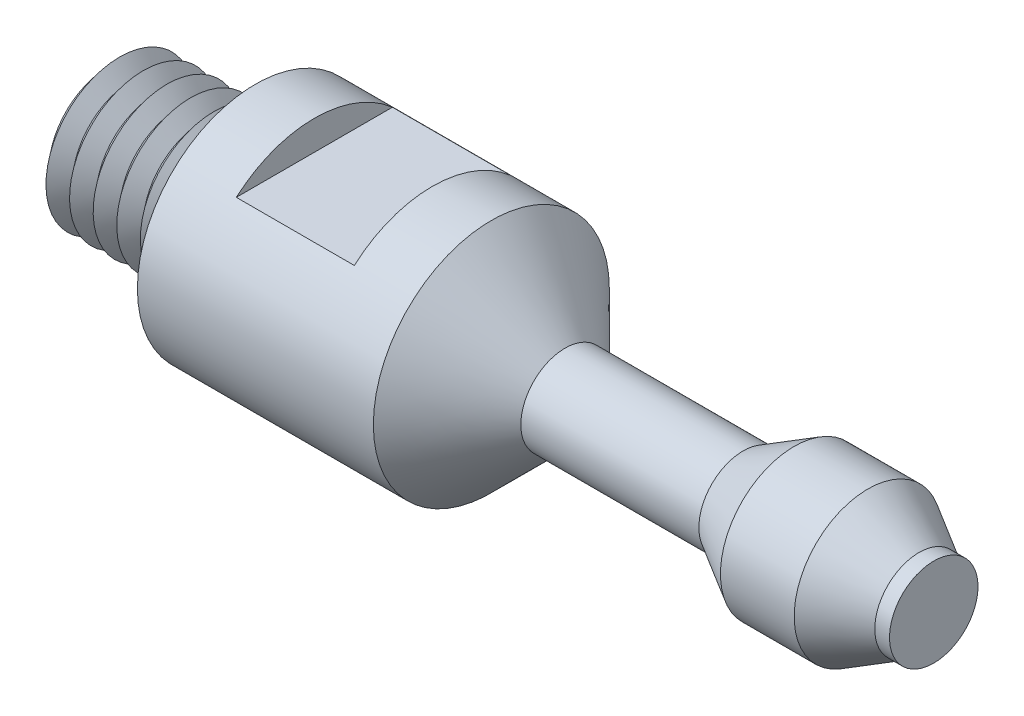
ISO-10303-21;
HEADER;
FILE_DESCRIPTION(('STEP AP214'),'2;1');
FILE_NAME('part.step','',(''),(''),'','','');
FILE_SCHEMA(('AUTOMOTIVE_DESIGN { 1 0 10303 214 1 1 1 1 }'));
ENDSEC;
DATA;
#1=APPLICATION_CONTEXT('core data for automotive mechanical design processes');
#2=APPLICATION_PROTOCOL_DEFINITION('international standard','automotive_design',2000,#1);
#3=PRODUCT_CONTEXT('',#1,'mechanical');
#4=PRODUCT('Part','Part','',(#3));
#5=PRODUCT_RELATED_PRODUCT_CATEGORY('part','',(#4));
#6=PRODUCT_DEFINITION_FORMATION('','',#4);
#7=PRODUCT_DEFINITION_CONTEXT('part definition',#1,'design');
#8=PRODUCT_DEFINITION('design','',#6,#7);
#9=PRODUCT_DEFINITION_SHAPE('','',#8);
#10=(LENGTH_UNIT() NAMED_UNIT(*) SI_UNIT(.MILLI.,.METRE.));
#11=(NAMED_UNIT(*) PLANE_ANGLE_UNIT() SI_UNIT($,.RADIAN.));
#12=(NAMED_UNIT(*) SI_UNIT($,.STERADIAN.) SOLID_ANGLE_UNIT());
#13=UNCERTAINTY_MEASURE_WITH_UNIT(LENGTH_MEASURE(1.E-05),#10,'distance_accuracy_value','');
#14=(GEOMETRIC_REPRESENTATION_CONTEXT(3) GLOBAL_UNCERTAINTY_ASSIGNED_CONTEXT((#13)) GLOBAL_UNIT_ASSIGNED_CONTEXT((#10,
#11,#12)) REPRESENTATION_CONTEXT('',''));
#15=CARTESIAN_POINT('',(0.,0.,0.));
#16=DIRECTION('',(0.,0.,1.));
#17=DIRECTION('',(1.,0.,0.));
#18=AXIS2_PLACEMENT_3D('',#15,#16,#17);
#19=CARTESIAN_POINT('',(0.,0.,0.));
#20=DIRECTION('',(1.,0.,0.));
#21=DIRECTION('',(0.,0.,-1.));
#22=AXIS2_PLACEMENT_3D('',#19,#20,#21);
#23=PLANE('',#22);
#24=CARTESIAN_POINT('',(0.,0.,0.));
#25=DIRECTION('',(1.,0.,0.));
#26=DIRECTION('',(0.,0.,-1.));
#27=AXIS2_PLACEMENT_3D('',#24,#25,#26);
#28=CIRCLE('',#27,1.5);
#29=CARTESIAN_POINT('',(0.,0.,-1.5));
#30=VERTEX_POINT('',#29);
#31=EDGE_CURVE('E113',#30,#30,#28,.T.);
#32=ORIENTED_EDGE('',*,*,#31,.T.);
#33=EDGE_LOOP('',(#32));
#34=FACE_BOUND('',#33,.T.);
#35=ADVANCED_FACE('F39',(#34),#23,.T.);
#36=CARTESIAN_POINT('',(0.,0.,0.));
#37=DIRECTION('',(1.,0.,0.));
#38=DIRECTION('',(0.,0.,-1.));
#39=AXIS2_PLACEMENT_3D('',#36,#37,#38);
#40=CYLINDRICAL_SURFACE('',#39,1.5);
#41=CARTESIAN_POINT('',(-0.5,0.,0.));
#42=DIRECTION('',(1.,0.,0.));
#43=DIRECTION('',(0.,0.,-1.));
#44=AXIS2_PLACEMENT_3D('',#41,#42,#43);
#45=CIRCLE('',#44,1.5);
#46=CARTESIAN_POINT('',(-0.5,0.,-1.5));
#47=VERTEX_POINT('',#46);
#48=EDGE_CURVE('E117',#47,#47,#45,.T.);
#49=ORIENTED_EDGE('',*,*,#48,.T.);
#50=EDGE_LOOP('',(#49));
#51=FACE_BOUND('',#50,.T.);
#52=ORIENTED_EDGE('',*,*,#31,.F.);
#53=EDGE_LOOP('',(#52));
#54=FACE_BOUND('',#53,.T.);
#55=ADVANCED_FACE('F272',(#51,#54),#40,.T.);
#56=CARTESIAN_POINT('',(-0.5,0.,0.));
#57=DIRECTION('',(-1.,0.,0.));
#58=DIRECTION('',(0.,0.,1.));
#59=AXIS2_PLACEMENT_3D('',#56,#57,#58);
#60=CONICAL_SURFACE('',#59,1.5,0.5235987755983);
#61=CARTESIAN_POINT('',(-2.23205080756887,0.,0.));
#62=DIRECTION('',(1.,0.,0.));
#63=DIRECTION('',(0.,0.,-1.));
#64=AXIS2_PLACEMENT_3D('',#61,#62,#63);
#65=CIRCLE('',#64,2.5);
#66=CARTESIAN_POINT('',(-2.23205080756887,0.,-2.5));
#67=VERTEX_POINT('',#66);
#68=EDGE_CURVE('E121',#67,#67,#65,.T.);
#69=ORIENTED_EDGE('',*,*,#68,.T.);
#70=EDGE_LOOP('',(#69));
#71=FACE_BOUND('',#70,.T.);
#72=ORIENTED_EDGE('',*,*,#48,.F.);
#73=EDGE_LOOP('',(#72));
#74=FACE_BOUND('',#73,.T.);
#75=ADVANCED_FACE('F277',(#71,#74),#60,.T.);
#76=CARTESIAN_POINT('',(0.,0.,0.));
#77=DIRECTION('',(1.,0.,0.));
#78=DIRECTION('',(0.,0.,-1.));
#79=AXIS2_PLACEMENT_3D('',#76,#77,#78);
#80=CYLINDRICAL_SURFACE('',#79,2.5);
#81=CARTESIAN_POINT('',(-4.73205080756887,0.,0.));
#82=DIRECTION('',(1.,0.,0.));
#83=DIRECTION('',(0.,0.,-1.));
#84=AXIS2_PLACEMENT_3D('',#81,#82,#83);
#85=CIRCLE('',#84,2.5);
#86=CARTESIAN_POINT('',(-4.73205080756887,0.,-2.5));
#87=VERTEX_POINT('',#86);
#88=EDGE_CURVE('E125',#87,#87,#85,.T.);
#89=ORIENTED_EDGE('',*,*,#88,.T.);
#90=EDGE_LOOP('',(#89));
#91=FACE_BOUND('',#90,.T.);
#92=ORIENTED_EDGE('',*,*,#68,.F.);
#93=EDGE_LOOP('',(#92));
#94=FACE_BOUND('',#93,.T.);
#95=ADVANCED_FACE('F284',(#91,#94),#80,.T.);
#96=CARTESIAN_POINT('',(-4.73205080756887,0.,0.));
#97=DIRECTION('',(1.,0.,0.));
#98=DIRECTION('',(0.,0.,-1.));
#99=AXIS2_PLACEMENT_3D('',#96,#97,#98);
#100=CONICAL_SURFACE('',#99,2.5,0.5235987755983);
#101=CARTESIAN_POINT('',(-6.46410161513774,0.,0.));
#102=DIRECTION('',(1.,0.,0.));
#103=DIRECTION('',(0.,0.,-1.));
#104=AXIS2_PLACEMENT_3D('',#101,#102,#103);
#105=CIRCLE('',#104,1.5);
#106=CARTESIAN_POINT('',(-6.46410161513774,0.,-1.5));
#107=VERTEX_POINT('',#106);
#108=EDGE_CURVE('E129',#107,#107,#105,.T.);
#109=ORIENTED_EDGE('',*,*,#108,.T.);
#110=EDGE_LOOP('',(#109));
#111=FACE_BOUND('',#110,.T.);
#112=ORIENTED_EDGE('',*,*,#88,.F.);
#113=EDGE_LOOP('',(#112));
#114=FACE_BOUND('',#113,.T.);
#115=ADVANCED_FACE('F290',(#111,#114),#100,.T.);
#116=CARTESIAN_POINT('',(0.,0.,0.));
#117=DIRECTION('',(1.,0.,0.));
#118=DIRECTION('',(0.,0.,-1.));
#119=AXIS2_PLACEMENT_3D('',#116,#117,#118);
#120=CYLINDRICAL_SURFACE('',#119,1.5);
#121=CARTESIAN_POINT('',(-12.5,0.,0.));
#122=DIRECTION('',(1.,0.,0.));
#123=DIRECTION('',(0.,0.,-1.));
#124=AXIS2_PLACEMENT_3D('',#121,#122,#123);
#125=CIRCLE('',#124,1.5);
#126=CARTESIAN_POINT('',(-12.5,0.,-1.5));
#127=VERTEX_POINT('',#126);
#128=EDGE_CURVE('E133',#127,#127,#125,.T.);
#129=ORIENTED_EDGE('',*,*,#128,.T.);
#130=EDGE_LOOP('',(#129));
#131=FACE_BOUND('',#130,.T.);
#132=ORIENTED_EDGE('',*,*,#108,.F.);
#133=EDGE_LOOP('',(#132));
#134=FACE_BOUND('',#133,.T.);
#135=ADVANCED_FACE('F294',(#131,#134),#120,.T.);
#136=CARTESIAN_POINT('',(-12.5,0.,0.));
#137=DIRECTION('',(-1.,0.,0.));
#138=DIRECTION('',(0.,0.,1.));
#139=AXIS2_PLACEMENT_3D('',#136,#137,#138);
#140=CONICAL_SURFACE('',#139,1.5,0.78539816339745);
#141=CARTESIAN_POINT('',(-15.,0.,0.));
#142=DIRECTION('',(1.,0.,0.));
#143=DIRECTION('',(0.,0.,-1.));
#144=AXIS2_PLACEMENT_3D('',#141,#142,#143);
#145=CIRCLE('',#144,4.);
#146=CARTESIAN_POINT('',(-15.,0.,-4.));
#147=VERTEX_POINT('',#146);
#148=EDGE_CURVE('E137',#147,#147,#145,.T.);
#149=ORIENTED_EDGE('',*,*,#148,.T.);
#150=EDGE_LOOP('',(#149));
#151=FACE_BOUND('',#150,.T.);
#152=ORIENTED_EDGE('',*,*,#128,.F.);
#153=EDGE_LOOP('',(#152));
#154=FACE_BOUND('',#153,.T.);
#155=ADVANCED_FACE('F298',(#151,#154),#140,.T.);
#156=CARTESIAN_POINT('',(0.,0.,0.));
#157=DIRECTION('',(1.,0.,0.));
#158=DIRECTION('',(0.,0.,-1.));
#159=AXIS2_PLACEMENT_3D('',#156,#157,#158);
#160=CYLINDRICAL_SURFACE('',#159,4.);
#161=DIRECTION('',(1.,0.,0.));
#162=VECTOR('',#161,1.);
#163=CARTESIAN_POINT('',(0.,3.,-2.64575131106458));
#164=LINE('',#163,#162);
#165=CARTESIAN_POINT('',(-17.,3.,-2.64575131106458));
#166=VERTEX_POINT('',#165);
#167=CARTESIAN_POINT('',(-21.,3.,-2.64575131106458));
#168=VERTEX_POINT('',#167);
#169=EDGE_CURVE('E11',#166,#168,#164,.F.);
#170=ORIENTED_EDGE('',*,*,#169,.F.);
#171=CARTESIAN_POINT('',(-17.,0.,0.));
#172=DIRECTION('',(1.,0.,0.));
#173=DIRECTION('',(0.,0.,-1.));
#174=AXIS2_PLACEMENT_3D('',#171,#172,#173);
#175=CIRCLE('',#174,4.);
#176=CARTESIAN_POINT('',(-17.,3.,2.64575131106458));
#177=VERTEX_POINT('',#176);
#178=EDGE_CURVE('E79',#177,#166,#175,.F.);
#179=ORIENTED_EDGE('',*,*,#178,.F.);
#180=DIRECTION('',(1.,0.,0.));
#181=VECTOR('',#180,1.);
#182=CARTESIAN_POINT('',(0.,3.,2.64575131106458));
#183=LINE('',#182,#181);
#184=CARTESIAN_POINT('',(-21.,3.,2.64575131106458));
#185=VERTEX_POINT('',#184);
#186=EDGE_CURVE('E87',#185,#177,#183,.T.);
#187=ORIENTED_EDGE('',*,*,#186,.F.);
#188=CARTESIAN_POINT('',(-21.,0.,0.));
#189=DIRECTION('',(-1.,0.,0.));
#190=DIRECTION('',(0.,0.,1.));
#191=AXIS2_PLACEMENT_3D('',#188,#189,#190);
#192=CIRCLE('',#191,4.);
#193=EDGE_CURVE('E47',#168,#185,#192,.F.);
#194=ORIENTED_EDGE('',*,*,#193,.F.);
#195=EDGE_LOOP('',(#170,#179,#187,#194));
#196=FACE_BOUND('',#195,.T.);
#197=CARTESIAN_POINT('',(-21.,0.,0.));
#198=DIRECTION('',(-1.,0.,0.));
#199=DIRECTION('',(0.,0.,1.));
#200=AXIS2_PLACEMENT_3D('',#197,#198,#199);
#201=CIRCLE('',#200,4.);
#202=CARTESIAN_POINT('',(-21.,-3.,2.64575131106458));
#203=VERTEX_POINT('',#202);
#204=CARTESIAN_POINT('',(-21.,-3.,-2.64575131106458));
#205=VERTEX_POINT('',#204);
#206=EDGE_CURVE('E101',#203,#205,#201,.F.);
#207=ORIENTED_EDGE('',*,*,#206,.F.);
#208=DIRECTION('',(1.,0.,0.));
#209=VECTOR('',#208,1.);
#210=CARTESIAN_POINT('',(0.,-3.,2.64575131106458));
#211=LINE('',#210,#209);
#212=CARTESIAN_POINT('',(-17.,-3.,2.64575131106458));
#213=VERTEX_POINT('',#212);
#214=EDGE_CURVE('E104',#213,#203,#211,.F.);
#215=ORIENTED_EDGE('',*,*,#214,.F.);
#216=CARTESIAN_POINT('',(-17.,0.,0.));
#217=DIRECTION('',(1.,0.,0.));
#218=DIRECTION('',(0.,0.,-1.));
#219=AXIS2_PLACEMENT_3D('',#216,#217,#218);
#220=CIRCLE('',#219,4.);
#221=CARTESIAN_POINT('',(-17.,-3.,-2.64575131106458));
#222=VERTEX_POINT('',#221);
#223=EDGE_CURVE('E110',#222,#213,#220,.F.);
#224=ORIENTED_EDGE('',*,*,#223,.F.);
#225=DIRECTION('',(1.,0.,0.));
#226=VECTOR('',#225,1.);
#227=CARTESIAN_POINT('',(0.,-3.,-2.64575131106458));
#228=LINE('',#227,#226);
#229=EDGE_CURVE('E107',#205,#222,#228,.T.);
#230=ORIENTED_EDGE('',*,*,#229,.F.);
#231=EDGE_LOOP('',(#207,#215,#224,#230));
#232=FACE_BOUND('',#231,.T.);
#233=CARTESIAN_POINT('',(-23.,0.,0.));
#234=DIRECTION('',(1.,0.,0.));
#235=DIRECTION('',(0.,0.,-1.));
#236=AXIS2_PLACEMENT_3D('',#233,#234,#235);
#237=CIRCLE('',#236,4.);
#238=CARTESIAN_POINT('',(-23.,0.,-4.));
#239=VERTEX_POINT('',#238);
#240=EDGE_CURVE('E141',#239,#239,#237,.T.);
#241=ORIENTED_EDGE('',*,*,#240,.T.);
#242=EDGE_LOOP('',(#241));
#243=FACE_BOUND('',#242,.T.);
#244=ORIENTED_EDGE('',*,*,#148,.F.);
#245=EDGE_LOOP('',(#244));
#246=FACE_BOUND('',#245,.T.);
#247=ADVANCED_FACE('F93',(#196,#232,#243,#246),#160,.T.);
#248=CARTESIAN_POINT('',(-23.,4.,0.));
#249=DIRECTION('',(-1.,0.,0.));
#250=DIRECTION('',(0.,0.,1.));
#251=AXIS2_PLACEMENT_3D('',#248,#249,#250);
#252=PLANE('',#251);
#253=CARTESIAN_POINT('',(-23.,0.,0.));
#254=DIRECTION('',(1.,0.,0.));
#255=DIRECTION('',(0.,0.,-1.));
#256=AXIS2_PLACEMENT_3D('',#253,#254,#255);
#257=CIRCLE('',#256,1.8);
#258=CARTESIAN_POINT('',(-23.,0.,-1.8));
#259=VERTEX_POINT('',#258);
#260=EDGE_CURVE('E145',#259,#259,#257,.T.);
#261=ORIENTED_EDGE('',*,*,#260,.T.);
#262=EDGE_LOOP('',(#261));
#263=FACE_BOUND('',#262,.T.);
#264=ORIENTED_EDGE('',*,*,#240,.F.);
#265=EDGE_LOOP('',(#264));
#266=FACE_BOUND('',#265,.T.);
#267=ADVANCED_FACE('F305',(#263,#266),#252,.T.);
#268=CARTESIAN_POINT('',(0.,0.,0.));
#269=DIRECTION('',(1.,0.,0.));
#270=DIRECTION('',(0.,0.,-1.));
#271=AXIS2_PLACEMENT_3D('',#268,#269,#270);
#272=CYLINDRICAL_SURFACE('',#271,1.8);
#273=CARTESIAN_POINT('',(-24.,0.,0.));
#274=DIRECTION('',(1.,0.,0.));
#275=DIRECTION('',(0.,0.,-1.));
#276=AXIS2_PLACEMENT_3D('',#273,#274,#275);
#277=CIRCLE('',#276,1.8);
#278=CARTESIAN_POINT('',(-24.,0.,-1.8));
#279=VERTEX_POINT('',#278);
#280=EDGE_CURVE('E149',#279,#279,#277,.T.);
#281=ORIENTED_EDGE('',*,*,#280,.T.);
#282=EDGE_LOOP('',(#281));
#283=FACE_BOUND('',#282,.T.);
#284=ORIENTED_EDGE('',*,*,#260,.F.);
#285=EDGE_LOOP('',(#284));
#286=FACE_BOUND('',#285,.T.);
#287=ADVANCED_FACE('F308',(#283,#286),#272,.T.);
#288=CARTESIAN_POINT('',(-24.,1.8,0.));
#289=DIRECTION('',(1.,0.,0.));
#290=DIRECTION('',(0.,0.,-1.));
#291=AXIS2_PLACEMENT_3D('',#288,#289,#290);
#292=PLANE('',#291);
#293=CARTESIAN_POINT('',(-24.,0.,0.));
#294=DIRECTION('',(1.,0.,0.));
#295=DIRECTION('',(0.,1.,0.));
#296=AXIS2_PLACEMENT_3D('',#293,#294,#295);
#297=CIRCLE('',#296,2.00040016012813);
#298=CARTESIAN_POINT('',(-24.,2.00040016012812,0.));
#299=VERTEX_POINT('',#298);
#300=EDGE_CURVE('E197',#299,#299,#297,.T.);
#301=ORIENTED_EDGE('',*,*,#300,.T.);
#302=EDGE_LOOP('',(#301));
#303=FACE_BOUND('',#302,.T.);
#304=ORIENTED_EDGE('',*,*,#280,.F.);
#305=EDGE_LOOP('',(#304));
#306=FACE_BOUND('',#305,.T.);
#307=ADVANCED_FACE('F311',(#303,#306),#292,.T.);
#308=CARTESIAN_POINT('',(-21.,-4.5,-4.));
#309=DIRECTION('',(-1.,0.,0.));
#310=DIRECTION('',(0.,0.,1.));
#311=AXIS2_PLACEMENT_3D('',#308,#309,#310);
#312=PLANE('',#311);
#313=ORIENTED_EDGE('',*,*,#206,.T.);
#314=DIRECTION('',(0.,0.,1.));
#315=VECTOR('',#314,1.);
#316=CARTESIAN_POINT('',(-21.,-3.,-4.));
#317=LINE('',#316,#315);
#318=EDGE_CURVE('E153',#205,#203,#317,.T.);
#319=ORIENTED_EDGE('',*,*,#318,.T.);
#320=EDGE_LOOP('',(#313,#319));
#321=FACE_BOUND('',#320,.T.);
#322=ADVANCED_FACE('F314',(#321),#312,.F.);
#323=CARTESIAN_POINT('',(-21.,-3.,-4.));
#324=DIRECTION('',(0.,1.,0.));
#325=DIRECTION('',(0.,0.,1.));
#326=AXIS2_PLACEMENT_3D('',#323,#324,#325);
#327=PLANE('',#326);
#328=ORIENTED_EDGE('',*,*,#214,.T.);
#329=ORIENTED_EDGE('',*,*,#318,.F.);
#330=ORIENTED_EDGE('',*,*,#229,.T.);
#331=DIRECTION('',(0.,0.,1.));
#332=VECTOR('',#331,1.);
#333=CARTESIAN_POINT('',(-17.,-3.,-4.));
#334=LINE('',#333,#332);
#335=EDGE_CURVE('E60',#222,#213,#334,.T.);
#336=ORIENTED_EDGE('',*,*,#335,.T.);
#337=EDGE_LOOP('',(#328,#329,#330,#336));
#338=FACE_BOUND('',#337,.T.);
#339=ADVANCED_FACE('F319',(#338),#327,.F.);
#340=CARTESIAN_POINT('',(-17.,-4.5,-4.));
#341=DIRECTION('',(1.,0.,0.));
#342=DIRECTION('',(0.,0.,-1.));
#343=AXIS2_PLACEMENT_3D('',#340,#341,#342);
#344=PLANE('',#343);
#345=ORIENTED_EDGE('',*,*,#223,.T.);
#346=ORIENTED_EDGE('',*,*,#335,.F.);
#347=EDGE_LOOP('',(#345,#346));
#348=FACE_BOUND('',#347,.T.);
#349=ADVANCED_FACE('F344',(#348),#344,.F.);
#350=CARTESIAN_POINT('',(-21.,4.49999999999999,-4.));
#351=DIRECTION('',(-1.,0.,0.));
#352=DIRECTION('',(0.,0.,1.));
#353=AXIS2_PLACEMENT_3D('',#350,#351,#352);
#354=PLANE('',#353);
#355=ORIENTED_EDGE('',*,*,#193,.T.);
#356=DIRECTION('',(0.,0.,1.));
#357=VECTOR('',#356,1.);
#358=CARTESIAN_POINT('',(-21.,3.,-4.));
#359=LINE('',#358,#357);
#360=EDGE_CURVE('E53',#168,#185,#359,.T.);
#361=ORIENTED_EDGE('',*,*,#360,.F.);
#362=EDGE_LOOP('',(#355,#361));
#363=FACE_BOUND('',#362,.T.);
#364=ADVANCED_FACE('F349',(#363),#354,.F.);
#365=CARTESIAN_POINT('',(-17.,4.49999999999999,-4.));
#366=DIRECTION('',(1.,0.,0.));
#367=DIRECTION('',(0.,0.,-1.));
#368=AXIS2_PLACEMENT_3D('',#365,#366,#367);
#369=PLANE('',#368);
#370=ORIENTED_EDGE('',*,*,#178,.T.);
#371=DIRECTION('',(0.,0.,1.));
#372=VECTOR('',#371,1.);
#373=CARTESIAN_POINT('',(-17.,3.,-4.));
#374=LINE('',#373,#372);
#375=EDGE_CURVE('E82',#166,#177,#374,.T.);
#376=ORIENTED_EDGE('',*,*,#375,.T.);
#377=EDGE_LOOP('',(#370,#376));
#378=FACE_BOUND('',#377,.T.);
#379=ADVANCED_FACE('F81',(#378),#369,.F.);
#380=CARTESIAN_POINT('',(-21.,3.,-4.));
#381=DIRECTION('',(0.,-1.,0.));
#382=DIRECTION('',(1.,0.,0.));
#383=AXIS2_PLACEMENT_3D('',#380,#381,#382);
#384=PLANE('',#383);
#385=ORIENTED_EDGE('',*,*,#169,.T.);
#386=ORIENTED_EDGE('',*,*,#360,.T.);
#387=ORIENTED_EDGE('',*,*,#186,.T.);
#388=ORIENTED_EDGE('',*,*,#375,.F.);
#389=EDGE_LOOP('',(#385,#386,#387,#388));
#390=FACE_BOUND('',#389,.T.);
#391=ADVANCED_FACE('F89',(#390),#384,.F.);
#392=CARTESIAN_POINT('',(-24.4,0.,0.));
#393=DIRECTION('',(-1.,0.,0.));
#394=DIRECTION('',(0.,-1.,0.));
#395=AXIS2_PLACEMENT_3D('',#392,#393,#394);
#396=CONICAL_SURFACE('',#395,2.5,0.895664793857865);
#397=ORIENTED_EDGE('',*,*,#300,.F.);
#398=EDGE_LOOP('',(#397));
#399=FACE_BOUND('',#398,.T.);
#400=CARTESIAN_POINT('',(-24.4,0.,0.));
#401=DIRECTION('',(1.,0.,0.));
#402=DIRECTION('',(0.,1.,0.));
#403=AXIS2_PLACEMENT_3D('',#400,#401,#402);
#404=CIRCLE('',#403,2.5);
#405=CARTESIAN_POINT('',(-24.4,2.49999999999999,0.));
#406=VERTEX_POINT('',#405);
#407=EDGE_CURVE('E201',#406,#406,#404,.T.);
#408=ORIENTED_EDGE('',*,*,#407,.T.);
#409=EDGE_LOOP('',(#408));
#410=FACE_BOUND('',#409,.T.);
#411=ADVANCED_FACE('F205',(#399,#410),#396,.T.);
#412=CARTESIAN_POINT('',(-28.,2.5,0.));
#413=DIRECTION('',(-1.,0.,0.));
#414=DIRECTION('',(0.,0.,1.));
#415=AXIS2_PLACEMENT_3D('',#412,#413,#414);
#416=PLANE('',#415);
#417=CARTESIAN_POINT('',(-28.,0.,0.));
#418=DIRECTION('',(1.,0.,0.));
#419=DIRECTION('',(0.,1.,0.));
#420=AXIS2_PLACEMENT_3D('',#417,#418,#419);
#421=CIRCLE('',#420,2.00040016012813);
#422=CARTESIAN_POINT('',(-28.,2.00040016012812,0.));
#423=VERTEX_POINT('',#422);
#424=EDGE_CURVE('E160',#423,#423,#421,.T.);
#425=ORIENTED_EDGE('',*,*,#424,.F.);
#426=EDGE_LOOP('',(#425));
#427=FACE_BOUND('',#426,.T.);
#428=ADVANCED_FACE('F258',(#427),#416,.T.);
#429=CARTESIAN_POINT('',(-28.,0.,0.));
#430=DIRECTION('',(1.,0.,0.));
#431=DIRECTION('',(0.,1.,0.));
#432=AXIS2_PLACEMENT_3D('',#429,#430,#431);
#433=CONICAL_SURFACE('',#432,2.00040016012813,0.895664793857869);
#434=CARTESIAN_POINT('',(-27.6,0.,0.));
#435=DIRECTION('',(1.,0.,0.));
#436=DIRECTION('',(0.,1.,0.));
#437=AXIS2_PLACEMENT_3D('',#434,#435,#436);
#438=CIRCLE('',#437,2.5);
#439=CARTESIAN_POINT('',(-27.6,2.5,0.));
#440=VERTEX_POINT('',#439);
#441=EDGE_CURVE('E169',#440,#440,#438,.T.);
#442=ORIENTED_EDGE('',*,*,#441,.F.);
#443=EDGE_LOOP('',(#442));
#444=FACE_BOUND('',#443,.T.);
#445=ORIENTED_EDGE('',*,*,#424,.T.);
#446=EDGE_LOOP('',(#445));
#447=FACE_BOUND('',#446,.T.);
#448=ADVANCED_FACE('F252',(#444,#447),#433,.T.);
#449=CARTESIAN_POINT('',(-27.6,0.,0.));
#450=DIRECTION('',(-1.,0.,0.));
#451=DIRECTION('',(0.,-1.,0.));
#452=AXIS2_PLACEMENT_3D('',#449,#450,#451);
#453=CONICAL_SURFACE('',#452,2.5,0.895664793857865);
#454=CARTESIAN_POINT('',(-27.2,0.,0.));
#455=DIRECTION('',(1.,0.,0.));
#456=DIRECTION('',(0.,1.,0.));
#457=AXIS2_PLACEMENT_3D('',#454,#455,#456);
#458=CIRCLE('',#457,2.00040016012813);
#459=CARTESIAN_POINT('',(-27.2,2.00040016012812,0.));
#460=VERTEX_POINT('',#459);
#461=EDGE_CURVE('E165',#460,#460,#458,.T.);
#462=ORIENTED_EDGE('',*,*,#461,.F.);
#463=EDGE_LOOP('',(#462));
#464=FACE_BOUND('',#463,.T.);
#465=ORIENTED_EDGE('',*,*,#441,.T.);
#466=EDGE_LOOP('',(#465));
#467=FACE_BOUND('',#466,.T.);
#468=ADVANCED_FACE('F246',(#464,#467),#453,.T.);
#469=CARTESIAN_POINT('',(-27.2,0.,0.));
#470=DIRECTION('',(1.,0.,0.));
#471=DIRECTION('',(0.,1.,0.));
#472=AXIS2_PLACEMENT_3D('',#469,#470,#471);
#473=CONICAL_SURFACE('',#472,2.00040016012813,0.895664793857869);
#474=CARTESIAN_POINT('',(-26.8,0.,0.));
#475=DIRECTION('',(1.,0.,0.));
#476=DIRECTION('',(0.,1.,0.));
#477=AXIS2_PLACEMENT_3D('',#474,#475,#476);
#478=CIRCLE('',#477,2.5);
#479=CARTESIAN_POINT('',(-26.8,2.5,0.));
#480=VERTEX_POINT('',#479);
#481=EDGE_CURVE('E177',#480,#480,#478,.T.);
#482=ORIENTED_EDGE('',*,*,#481,.F.);
#483=EDGE_LOOP('',(#482));
#484=FACE_BOUND('',#483,.T.);
#485=ORIENTED_EDGE('',*,*,#461,.T.);
#486=EDGE_LOOP('',(#485));
#487=FACE_BOUND('',#486,.T.);
#488=ADVANCED_FACE('F240',(#484,#487),#473,.T.);
#489=CARTESIAN_POINT('',(-26.8,0.,0.));
#490=DIRECTION('',(-1.,0.,0.));
#491=DIRECTION('',(0.,-1.,0.));
#492=AXIS2_PLACEMENT_3D('',#489,#490,#491);
#493=CONICAL_SURFACE('',#492,2.5,0.895664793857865);
#494=CARTESIAN_POINT('',(-26.4,0.,0.));
#495=DIRECTION('',(1.,0.,0.));
#496=DIRECTION('',(0.,1.,0.));
#497=AXIS2_PLACEMENT_3D('',#494,#495,#496);
#498=CIRCLE('',#497,2.00040016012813);
#499=CARTESIAN_POINT('',(-26.4,2.00040016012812,0.));
#500=VERTEX_POINT('',#499);
#501=EDGE_CURVE('E173',#500,#500,#498,.T.);
#502=ORIENTED_EDGE('',*,*,#501,.F.);
#503=EDGE_LOOP('',(#502));
#504=FACE_BOUND('',#503,.T.);
#505=ORIENTED_EDGE('',*,*,#481,.T.);
#506=EDGE_LOOP('',(#505));
#507=FACE_BOUND('',#506,.T.);
#508=ADVANCED_FACE('F234',(#504,#507),#493,.T.);
#509=CARTESIAN_POINT('',(-26.4,0.,0.));
#510=DIRECTION('',(1.,0.,0.));
#511=DIRECTION('',(0.,1.,0.));
#512=AXIS2_PLACEMENT_3D('',#509,#510,#511);
#513=CONICAL_SURFACE('',#512,2.00040016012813,0.895664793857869);
#514=CARTESIAN_POINT('',(-26.,0.,0.));
#515=DIRECTION('',(1.,0.,0.));
#516=DIRECTION('',(0.,1.,0.));
#517=AXIS2_PLACEMENT_3D('',#514,#515,#516);
#518=CIRCLE('',#517,2.5);
#519=CARTESIAN_POINT('',(-26.,2.5,0.));
#520=VERTEX_POINT('',#519);
#521=EDGE_CURVE('E185',#520,#520,#518,.T.);
#522=ORIENTED_EDGE('',*,*,#521,.F.);
#523=EDGE_LOOP('',(#522));
#524=FACE_BOUND('',#523,.T.);
#525=ORIENTED_EDGE('',*,*,#501,.T.);
#526=EDGE_LOOP('',(#525));
#527=FACE_BOUND('',#526,.T.);
#528=ADVANCED_FACE('F228',(#524,#527),#513,.T.);
#529=CARTESIAN_POINT('',(-26.,0.,0.));
#530=DIRECTION('',(-1.,0.,0.));
#531=DIRECTION('',(0.,-1.,0.));
#532=AXIS2_PLACEMENT_3D('',#529,#530,#531);
#533=CONICAL_SURFACE('',#532,2.5,0.895664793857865);
#534=CARTESIAN_POINT('',(-25.6,0.,0.));
#535=DIRECTION('',(1.,0.,0.));
#536=DIRECTION('',(0.,1.,0.));
#537=AXIS2_PLACEMENT_3D('',#534,#535,#536);
#538=CIRCLE('',#537,2.00040016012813);
#539=CARTESIAN_POINT('',(-25.6,2.00040016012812,0.));
#540=VERTEX_POINT('',#539);
#541=EDGE_CURVE('E181',#540,#540,#538,.T.);
#542=ORIENTED_EDGE('',*,*,#541,.F.);
#543=EDGE_LOOP('',(#542));
#544=FACE_BOUND('',#543,.T.);
#545=ORIENTED_EDGE('',*,*,#521,.T.);
#546=EDGE_LOOP('',(#545));
#547=FACE_BOUND('',#546,.T.);
#548=ADVANCED_FACE('F222',(#544,#547),#533,.T.);
#549=CARTESIAN_POINT('',(-25.6,0.,0.));
#550=DIRECTION('',(1.,0.,0.));
#551=DIRECTION('',(0.,1.,0.));
#552=AXIS2_PLACEMENT_3D('',#549,#550,#551);
#553=CONICAL_SURFACE('',#552,2.00040016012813,0.895664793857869);
#554=CARTESIAN_POINT('',(-25.2,0.,0.));
#555=DIRECTION('',(1.,0.,0.));
#556=DIRECTION('',(0.,1.,0.));
#557=AXIS2_PLACEMENT_3D('',#554,#555,#556);
#558=CIRCLE('',#557,2.5);
#559=CARTESIAN_POINT('',(-25.2,2.49999999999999,0.));
#560=VERTEX_POINT('',#559);
#561=EDGE_CURVE('E193',#560,#560,#558,.T.);
#562=ORIENTED_EDGE('',*,*,#561,.F.);
#563=EDGE_LOOP('',(#562));
#564=FACE_BOUND('',#563,.T.);
#565=ORIENTED_EDGE('',*,*,#541,.T.);
#566=EDGE_LOOP('',(#565));
#567=FACE_BOUND('',#566,.T.);
#568=ADVANCED_FACE('F216',(#564,#567),#553,.T.);
#569=CARTESIAN_POINT('',(-25.2,0.,0.));
#570=DIRECTION('',(-1.,0.,0.));
#571=DIRECTION('',(0.,-1.,0.));
#572=AXIS2_PLACEMENT_3D('',#569,#570,#571);
#573=CONICAL_SURFACE('',#572,2.5,0.895664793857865);
#574=CARTESIAN_POINT('',(-24.8,0.,0.));
#575=DIRECTION('',(1.,0.,0.));
#576=DIRECTION('',(0.,1.,0.));
#577=AXIS2_PLACEMENT_3D('',#574,#575,#576);
#578=CIRCLE('',#577,2.00040016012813);
#579=CARTESIAN_POINT('',(-24.8,2.00040016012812,0.));
#580=VERTEX_POINT('',#579);
#581=EDGE_CURVE('E189',#580,#580,#578,.T.);
#582=ORIENTED_EDGE('',*,*,#581,.F.);
#583=EDGE_LOOP('',(#582));
#584=FACE_BOUND('',#583,.T.);
#585=ORIENTED_EDGE('',*,*,#561,.T.);
#586=EDGE_LOOP('',(#585));
#587=FACE_BOUND('',#586,.T.);
#588=ADVANCED_FACE('F210',(#584,#587),#573,.T.);
#589=CARTESIAN_POINT('',(-24.8,0.,0.));
#590=DIRECTION('',(1.,0.,0.));
#591=DIRECTION('',(0.,1.,0.));
#592=AXIS2_PLACEMENT_3D('',#589,#590,#591);
#593=CONICAL_SURFACE('',#592,2.00040016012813,0.895664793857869);
#594=ORIENTED_EDGE('',*,*,#407,.F.);
#595=EDGE_LOOP('',(#594));
#596=FACE_BOUND('',#595,.T.);
#597=ORIENTED_EDGE('',*,*,#581,.T.);
#598=EDGE_LOOP('',(#597));
#599=FACE_BOUND('',#598,.T.);
#600=ADVANCED_FACE('F207',(#596,#599),#593,.T.);
#601=CLOSED_SHELL('',(#35,#55,#75,#95,#115,#135,#155,#247,#267,#287,#307,#322,#339,#349,#364,
#379,#391,#411,#428,#448,#468,#488,#508,#528,#548,#568,#588,#600));
#602=MANIFOLD_SOLID_BREP('B2',#601);
#603=ADVANCED_BREP_SHAPE_REPRESENTATION('',(#18,#602),#14);
#604=SHAPE_DEFINITION_REPRESENTATION(#9,#603);
ENDSEC;
END-ISO-10303-21;
